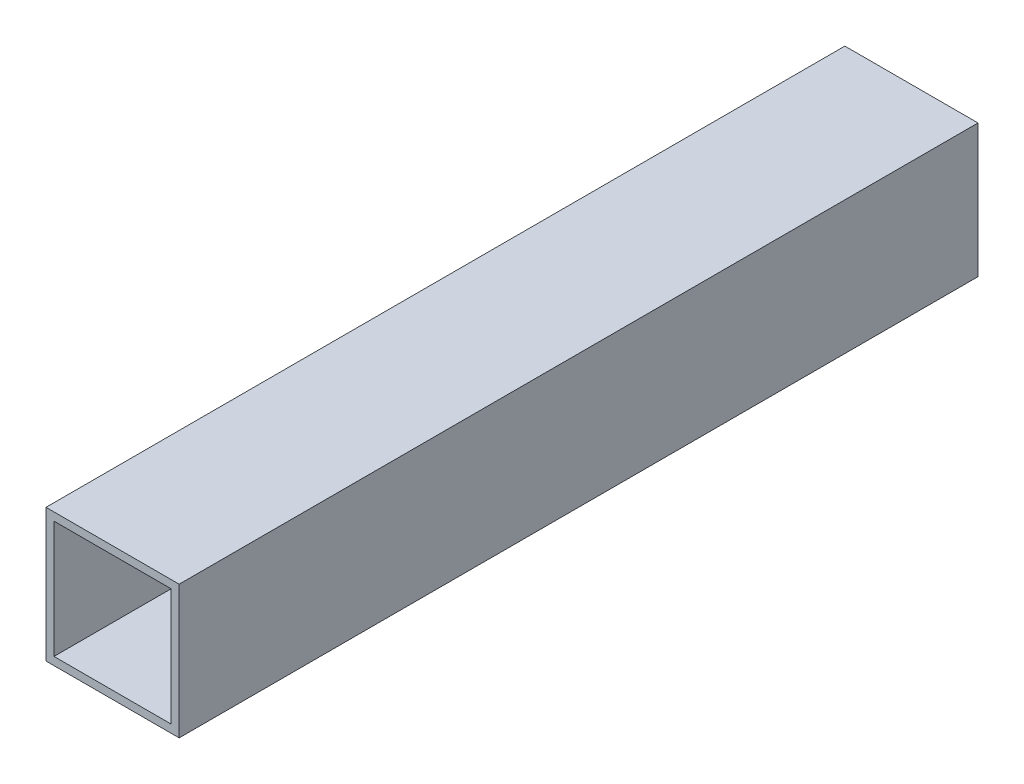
ISO-10303-21;
HEADER;
FILE_DESCRIPTION(('STEP AP214'),'2;1');
FILE_NAME('part.step','',(''),(''),'','','');
FILE_SCHEMA(('AUTOMOTIVE_DESIGN { 1 0 10303 214 1 1 1 1 }'));
ENDSEC;
DATA;
#1=APPLICATION_CONTEXT('core data for automotive mechanical design processes');
#2=APPLICATION_PROTOCOL_DEFINITION('international standard','automotive_design',2000,#1);
#3=PRODUCT_CONTEXT('',#1,'mechanical');
#4=PRODUCT('Part','Part','',(#3));
#5=PRODUCT_RELATED_PRODUCT_CATEGORY('part','',(#4));
#6=PRODUCT_DEFINITION_FORMATION('','',#4);
#7=PRODUCT_DEFINITION_CONTEXT('part definition',#1,'design');
#8=PRODUCT_DEFINITION('design','',#6,#7);
#9=PRODUCT_DEFINITION_SHAPE('','',#8);
#10=(LENGTH_UNIT() NAMED_UNIT(*) SI_UNIT(.MILLI.,.METRE.));
#11=(NAMED_UNIT(*) PLANE_ANGLE_UNIT() SI_UNIT($,.RADIAN.));
#12=(NAMED_UNIT(*) SI_UNIT($,.STERADIAN.) SOLID_ANGLE_UNIT());
#13=UNCERTAINTY_MEASURE_WITH_UNIT(LENGTH_MEASURE(1.E-05),#10,'distance_accuracy_value','');
#14=(GEOMETRIC_REPRESENTATION_CONTEXT(3) GLOBAL_UNCERTAINTY_ASSIGNED_CONTEXT((#13)) GLOBAL_UNIT_ASSIGNED_CONTEXT((#10,
#11,#12)) REPRESENTATION_CONTEXT('',''));
#15=CARTESIAN_POINT('',(0.,0.,0.));
#16=DIRECTION('',(0.,0.,1.));
#17=DIRECTION('',(1.,0.,0.));
#18=AXIS2_PLACEMENT_3D('',#15,#16,#17);
#19=CARTESIAN_POINT('',(-42.,-43.2,-150.));
#20=DIRECTION('',(-1.,0.,0.));
#21=DIRECTION('',(0.,0.,1.));
#22=AXIS2_PLACEMENT_3D('',#19,#20,#21);
#23=PLANE('',#22);
#24=DIRECTION('',(0.,-1.,0.));
#25=VECTOR('',#24,1.);
#26=CARTESIAN_POINT('',(-42.,-43.2,0.));
#27=LINE('',#26,#25);
#28=CARTESIAN_POINT('',(-42.,-43.2,0.));
#29=VERTEX_POINT('',#28);
#30=CARTESIAN_POINT('',(-42.,-68.2,0.));
#31=VERTEX_POINT('',#30);
#32=EDGE_CURVE('E131',#29,#31,#27,.T.);
#33=ORIENTED_EDGE('',*,*,#32,.F.);
#34=DIRECTION('',(0.,0.,1.));
#35=VECTOR('',#34,1.);
#36=CARTESIAN_POINT('',(-42.,-43.2,-150.));
#37=LINE('',#36,#35);
#38=CARTESIAN_POINT('',(-42.,-43.2,-150.));
#39=VERTEX_POINT('',#38);
#40=EDGE_CURVE('E11',#39,#29,#37,.T.);
#41=ORIENTED_EDGE('',*,*,#40,.F.);
#42=DIRECTION('',(0.,-1.,0.));
#43=VECTOR('',#42,1.);
#44=CARTESIAN_POINT('',(-42.,-43.2,-150.));
#45=LINE('',#44,#43);
#46=CARTESIAN_POINT('',(-42.,-68.2,-150.));
#47=VERTEX_POINT('',#46);
#48=EDGE_CURVE('E135',#39,#47,#45,.T.);
#49=ORIENTED_EDGE('',*,*,#48,.T.);
#50=DIRECTION('',(0.,0.,1.));
#51=VECTOR('',#50,1.);
#52=CARTESIAN_POINT('',(-42.,-68.2,-150.));
#53=LINE('',#52,#51);
#54=EDGE_CURVE('E36',#47,#31,#53,.T.);
#55=ORIENTED_EDGE('',*,*,#54,.T.);
#56=EDGE_LOOP('',(#33,#41,#49,#55));
#57=FACE_BOUND('',#56,.T.);
#58=ADVANCED_FACE('F33',(#57),#23,.T.);
#59=CARTESIAN_POINT('',(-42.,-43.2,-150.));
#60=DIRECTION('',(0.,1.,0.));
#61=DIRECTION('',(0.,0.,1.));
#62=AXIS2_PLACEMENT_3D('',#59,#60,#61);
#63=PLANE('',#62);
#64=DIRECTION('',(-1.,0.,0.));
#65=VECTOR('',#64,1.);
#66=CARTESIAN_POINT('',(-42.,-43.2,0.));
#67=LINE('',#66,#65);
#68=CARTESIAN_POINT('',(-17.,-43.2,0.));
#69=VERTEX_POINT('',#68);
#70=EDGE_CURVE('E139',#69,#29,#67,.T.);
#71=ORIENTED_EDGE('',*,*,#70,.F.);
#72=DIRECTION('',(0.,0.,1.));
#73=VECTOR('',#72,1.);
#74=CARTESIAN_POINT('',(-17.,-43.2,-150.));
#75=LINE('',#74,#73);
#76=CARTESIAN_POINT('',(-17.,-43.2,-150.));
#77=VERTEX_POINT('',#76);
#78=EDGE_CURVE('E41',#77,#69,#75,.T.);
#79=ORIENTED_EDGE('',*,*,#78,.F.);
#80=DIRECTION('',(-1.,0.,0.));
#81=VECTOR('',#80,1.);
#82=CARTESIAN_POINT('',(-42.,-43.2,-150.));
#83=LINE('',#82,#81);
#84=EDGE_CURVE('E145',#77,#39,#83,.T.);
#85=ORIENTED_EDGE('',*,*,#84,.T.);
#86=ORIENTED_EDGE('',*,*,#40,.T.);
#87=EDGE_LOOP('',(#71,#79,#85,#86));
#88=FACE_BOUND('',#87,.T.);
#89=ADVANCED_FACE('F171',(#88),#63,.T.);
#90=CARTESIAN_POINT('',(-17.,-43.2,-150.));
#91=DIRECTION('',(1.,0.,0.));
#92=DIRECTION('',(0.,1.,0.));
#93=AXIS2_PLACEMENT_3D('',#90,#91,#92);
#94=PLANE('',#93);
#95=DIRECTION('',(0.,1.,0.));
#96=VECTOR('',#95,1.);
#97=CARTESIAN_POINT('',(-17.,-43.2,0.));
#98=LINE('',#97,#96);
#99=CARTESIAN_POINT('',(-17.,-68.2,0.));
#100=VERTEX_POINT('',#99);
#101=EDGE_CURVE('E153',#100,#69,#98,.T.);
#102=ORIENTED_EDGE('',*,*,#101,.F.);
#103=DIRECTION('',(0.,0.,1.));
#104=VECTOR('',#103,1.);
#105=CARTESIAN_POINT('',(-17.,-68.2,-150.));
#106=LINE('',#105,#104);
#107=CARTESIAN_POINT('',(-17.,-68.2,-150.));
#108=VERTEX_POINT('',#107);
#109=EDGE_CURVE('E158',#108,#100,#106,.T.);
#110=ORIENTED_EDGE('',*,*,#109,.F.);
#111=DIRECTION('',(0.,1.,0.));
#112=VECTOR('',#111,1.);
#113=CARTESIAN_POINT('',(-17.,-43.2,-150.));
#114=LINE('',#113,#112);
#115=EDGE_CURVE('E142',#108,#77,#114,.T.);
#116=ORIENTED_EDGE('',*,*,#115,.T.);
#117=ORIENTED_EDGE('',*,*,#78,.T.);
#118=EDGE_LOOP('',(#102,#110,#116,#117));
#119=FACE_BOUND('',#118,.T.);
#120=ADVANCED_FACE('F175',(#119),#94,.T.);
#121=CARTESIAN_POINT('',(-42.,-68.2,-150.));
#122=DIRECTION('',(0.,-1.,0.));
#123=DIRECTION('',(0.,0.,-1.));
#124=AXIS2_PLACEMENT_3D('',#121,#122,#123);
#125=PLANE('',#124);
#126=DIRECTION('',(1.,0.,0.));
#127=VECTOR('',#126,1.);
#128=CARTESIAN_POINT('',(-42.,-68.2,0.));
#129=LINE('',#128,#127);
#130=EDGE_CURVE('E150',#31,#100,#129,.T.);
#131=ORIENTED_EDGE('',*,*,#130,.F.);
#132=ORIENTED_EDGE('',*,*,#54,.F.);
#133=DIRECTION('',(1.,0.,0.));
#134=VECTOR('',#133,1.);
#135=CARTESIAN_POINT('',(-42.,-68.2,-150.));
#136=LINE('',#135,#134);
#137=EDGE_CURVE('E138',#47,#108,#136,.T.);
#138=ORIENTED_EDGE('',*,*,#137,.T.);
#139=ORIENTED_EDGE('',*,*,#109,.T.);
#140=EDGE_LOOP('',(#131,#132,#138,#139));
#141=FACE_BOUND('',#140,.T.);
#142=ADVANCED_FACE('F166',(#141),#125,.T.);
#143=CARTESIAN_POINT('',(0.,0.,-150.));
#144=DIRECTION('',(0.,0.,1.));
#145=DIRECTION('',(1.,0.,0.));
#146=AXIS2_PLACEMENT_3D('',#143,#144,#145);
#147=PLANE('',#146);
#148=DIRECTION('',(-1.,0.,0.));
#149=VECTOR('',#148,1.);
#150=CARTESIAN_POINT('',(-40.5,-44.7,-150.));
#151=LINE('',#150,#149);
#152=CARTESIAN_POINT('',(-18.5,-44.7,-150.));
#153=VERTEX_POINT('',#152);
#154=CARTESIAN_POINT('',(-40.5,-44.7,-150.));
#155=VERTEX_POINT('',#154);
#156=EDGE_CURVE('E106',#153,#155,#151,.T.);
#157=ORIENTED_EDGE('',*,*,#156,.T.);
#158=DIRECTION('',(0.,-1.,0.));
#159=VECTOR('',#158,1.);
#160=CARTESIAN_POINT('',(-40.5,-44.7,-150.));
#161=LINE('',#160,#159);
#162=CARTESIAN_POINT('',(-40.5,-66.7,-150.));
#163=VERTEX_POINT('',#162);
#164=EDGE_CURVE('E100',#155,#163,#161,.T.);
#165=ORIENTED_EDGE('',*,*,#164,.T.);
#166=DIRECTION('',(1.,0.,0.));
#167=VECTOR('',#166,1.);
#168=CARTESIAN_POINT('',(-40.5,-66.7,-150.));
#169=LINE('',#168,#167);
#170=CARTESIAN_POINT('',(-18.5,-66.7,-150.));
#171=VERTEX_POINT('',#170);
#172=EDGE_CURVE('E109',#163,#171,#169,.T.);
#173=ORIENTED_EDGE('',*,*,#172,.T.);
#174=DIRECTION('',(0.,1.,0.));
#175=VECTOR('',#174,1.);
#176=CARTESIAN_POINT('',(-18.5,-44.7,-150.));
#177=LINE('',#176,#175);
#178=EDGE_CURVE('E49',#171,#153,#177,.T.);
#179=ORIENTED_EDGE('',*,*,#178,.T.);
#180=EDGE_LOOP('',(#157,#165,#173,#179));
#181=FACE_BOUND('',#180,.T.);
#182=ORIENTED_EDGE('',*,*,#48,.F.);
#183=ORIENTED_EDGE('',*,*,#84,.F.);
#184=ORIENTED_EDGE('',*,*,#115,.F.);
#185=ORIENTED_EDGE('',*,*,#137,.F.);
#186=EDGE_LOOP('',(#182,#183,#184,#185));
#187=FACE_BOUND('',#186,.T.);
#188=ADVANCED_FACE('F113',(#181,#187),#147,.F.);
#189=CARTESIAN_POINT('',(0.,0.,0.));
#190=DIRECTION('',(0.,0.,1.));
#191=DIRECTION('',(1.,0.,0.));
#192=AXIS2_PLACEMENT_3D('',#189,#190,#191);
#193=PLANE('',#192);
#194=DIRECTION('',(0.,-1.,0.));
#195=VECTOR('',#194,1.);
#196=CARTESIAN_POINT('',(-40.5,-44.7,0.));
#197=LINE('',#196,#195);
#198=CARTESIAN_POINT('',(-40.5,-44.7,0.));
#199=VERTEX_POINT('',#198);
#200=CARTESIAN_POINT('',(-40.5,-66.7,0.));
#201=VERTEX_POINT('',#200);
#202=EDGE_CURVE('E57',#199,#201,#197,.T.);
#203=ORIENTED_EDGE('',*,*,#202,.F.);
#204=DIRECTION('',(-1.,0.,0.));
#205=VECTOR('',#204,1.);
#206=CARTESIAN_POINT('',(-40.5,-44.7,0.));
#207=LINE('',#206,#205);
#208=CARTESIAN_POINT('',(-18.5,-44.7,0.));
#209=VERTEX_POINT('',#208);
#210=EDGE_CURVE('E116',#209,#199,#207,.T.);
#211=ORIENTED_EDGE('',*,*,#210,.F.);
#212=DIRECTION('',(0.,1.,0.));
#213=VECTOR('',#212,1.);
#214=CARTESIAN_POINT('',(-18.5,-44.7,0.));
#215=LINE('',#214,#213);
#216=CARTESIAN_POINT('',(-18.5,-66.7,0.));
#217=VERTEX_POINT('',#216);
#218=EDGE_CURVE('E119',#217,#209,#215,.T.);
#219=ORIENTED_EDGE('',*,*,#218,.F.);
#220=DIRECTION('',(1.,0.,0.));
#221=VECTOR('',#220,1.);
#222=CARTESIAN_POINT('',(-40.5,-66.7,0.));
#223=LINE('',#222,#221);
#224=EDGE_CURVE('E125',#201,#217,#223,.T.);
#225=ORIENTED_EDGE('',*,*,#224,.F.);
#226=EDGE_LOOP('',(#203,#211,#219,#225));
#227=FACE_BOUND('',#226,.T.);
#228=ORIENTED_EDGE('',*,*,#32,.T.);
#229=ORIENTED_EDGE('',*,*,#130,.T.);
#230=ORIENTED_EDGE('',*,*,#101,.T.);
#231=ORIENTED_EDGE('',*,*,#70,.T.);
#232=EDGE_LOOP('',(#228,#229,#230,#231));
#233=FACE_BOUND('',#232,.T.);
#234=ADVANCED_FACE('F168',(#227,#233),#193,.T.);
#235=CARTESIAN_POINT('',(-40.5,-44.7,-150.));
#236=DIRECTION('',(-1.,0.,0.));
#237=DIRECTION('',(0.,0.,1.));
#238=AXIS2_PLACEMENT_3D('',#235,#236,#237);
#239=PLANE('',#238);
#240=ORIENTED_EDGE('',*,*,#202,.T.);
#241=DIRECTION('',(0.,0.,1.));
#242=VECTOR('',#241,1.);
#243=CARTESIAN_POINT('',(-40.5,-66.7,-150.));
#244=LINE('',#243,#242);
#245=EDGE_CURVE('E96',#163,#201,#244,.T.);
#246=ORIENTED_EDGE('',*,*,#245,.F.);
#247=ORIENTED_EDGE('',*,*,#164,.F.);
#248=DIRECTION('',(0.,0.,1.));
#249=VECTOR('',#248,1.);
#250=CARTESIAN_POINT('',(-40.5,-44.7,-150.));
#251=LINE('',#250,#249);
#252=EDGE_CURVE('E129',#155,#199,#251,.T.);
#253=ORIENTED_EDGE('',*,*,#252,.T.);
#254=EDGE_LOOP('',(#240,#246,#247,#253));
#255=FACE_BOUND('',#254,.T.);
#256=ADVANCED_FACE('F98',(#255),#239,.F.);
#257=CARTESIAN_POINT('',(-40.5,-44.7,-150.));
#258=DIRECTION('',(0.,1.,0.));
#259=DIRECTION('',(0.,0.,1.));
#260=AXIS2_PLACEMENT_3D('',#257,#258,#259);
#261=PLANE('',#260);
#262=ORIENTED_EDGE('',*,*,#210,.T.);
#263=ORIENTED_EDGE('',*,*,#252,.F.);
#264=ORIENTED_EDGE('',*,*,#156,.F.);
#265=DIRECTION('',(0.,0.,1.));
#266=VECTOR('',#265,1.);
#267=CARTESIAN_POINT('',(-18.5,-44.7,-150.));
#268=LINE('',#267,#266);
#269=EDGE_CURVE('E132',#153,#209,#268,.T.);
#270=ORIENTED_EDGE('',*,*,#269,.T.);
#271=EDGE_LOOP('',(#262,#263,#264,#270));
#272=FACE_BOUND('',#271,.T.);
#273=ADVANCED_FACE('F226',(#272),#261,.F.);
#274=CARTESIAN_POINT('',(-18.5,-44.7,-150.));
#275=DIRECTION('',(1.,0.,0.));
#276=DIRECTION('',(0.,1.,0.));
#277=AXIS2_PLACEMENT_3D('',#274,#275,#276);
#278=PLANE('',#277);
#279=ORIENTED_EDGE('',*,*,#218,.T.);
#280=ORIENTED_EDGE('',*,*,#269,.F.);
#281=ORIENTED_EDGE('',*,*,#178,.F.);
#282=DIRECTION('',(0.,0.,1.));
#283=VECTOR('',#282,1.);
#284=CARTESIAN_POINT('',(-18.5,-66.7,-150.));
#285=LINE('',#284,#283);
#286=EDGE_CURVE('E105',#171,#217,#285,.T.);
#287=ORIENTED_EDGE('',*,*,#286,.T.);
#288=EDGE_LOOP('',(#279,#280,#281,#287));
#289=FACE_BOUND('',#288,.T.);
#290=ADVANCED_FACE('F235',(#289),#278,.F.);
#291=CARTESIAN_POINT('',(-40.5,-66.7,-150.));
#292=DIRECTION('',(0.,-1.,0.));
#293=DIRECTION('',(0.,0.,-1.));
#294=AXIS2_PLACEMENT_3D('',#291,#292,#293);
#295=PLANE('',#294);
#296=ORIENTED_EDGE('',*,*,#224,.T.);
#297=ORIENTED_EDGE('',*,*,#286,.F.);
#298=ORIENTED_EDGE('',*,*,#172,.F.);
#299=ORIENTED_EDGE('',*,*,#245,.T.);
#300=EDGE_LOOP('',(#296,#297,#298,#299));
#301=FACE_BOUND('',#300,.T.);
#302=ADVANCED_FACE('F110',(#301),#295,.F.);
#303=CLOSED_SHELL('',(#58,#89,#120,#142,#188,#234,#256,#273,#290,#302));
#304=MANIFOLD_SOLID_BREP('B2',#303);
#305=ADVANCED_BREP_SHAPE_REPRESENTATION('',(#18,#304),#14);
#306=SHAPE_DEFINITION_REPRESENTATION(#9,#305);
ENDSEC;
END-ISO-10303-21;
